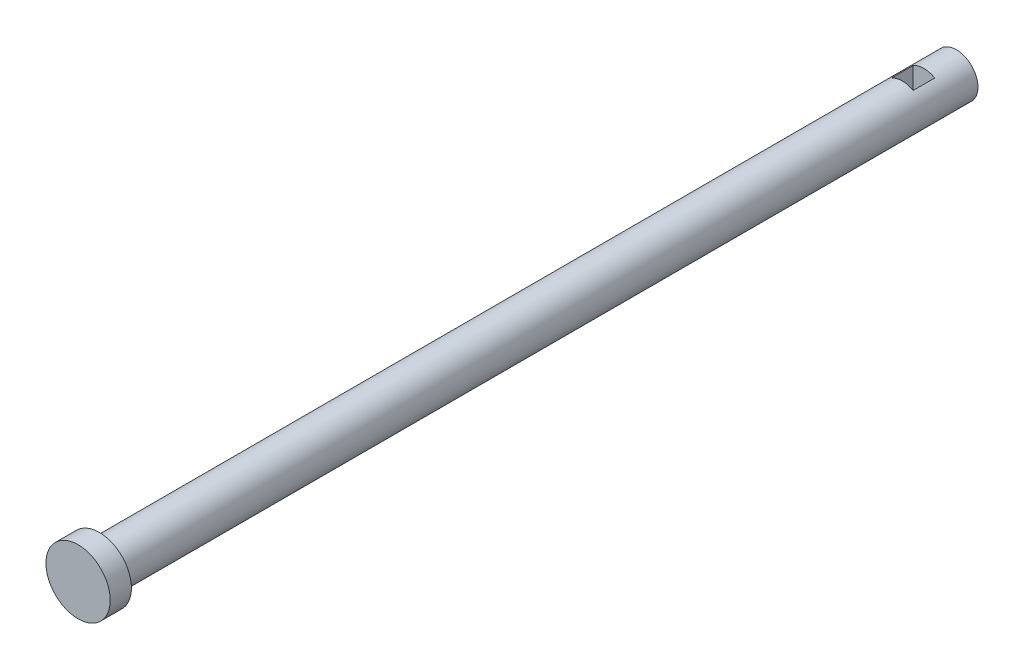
from build123d import *

# Parameters (mm, degrees)
CROQUIS1_R                 = 10
SALIENTE_EXTRUIR1_DEPTH    = 395.8
CROQUIS2_R                 = 14.840770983
SALIENTE_EXTRUIR2_DEPTH    = 9.8
CORTAR_EXTRUIR2_DEPTH      = 407.142655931
CORTAR_EXTRUIR2_DEPTH_BACK = 407.142655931
CROQUIS3_W                 = 10
CROQUIS3_H                 = 10


with BuildPart() as part:
    # Croquis1 → Saliente-Extruir1 (new body)
    with BuildSketch(Plane.XY):
        Circle(CROQUIS1_R)
    extrude(amount=SALIENTE_EXTRUIR1_DEPTH)

    # Croquis2 → Saliente-Extruir2 (add)
    with BuildSketch(Plane.XY.offset(395.8)):
        Circle(CROQUIS2_R)
    extrude(amount=SALIENTE_EXTRUIR2_DEPTH)

    # Croquis3 → Cortar-Extruir2 (cut, two sides: drawn at the far end of the back side and taken through both)
    with BuildSketch(Plane(origin=(0, 0, 0), x_dir=(1, 0, 0), z_dir=(0, 1, 0)).offset(-CORTAR_EXTRUIR2_DEPTH_BACK)):
        with Locations((0, -20)):
            Rectangle(CROQUIS3_W, CROQUIS3_H)
    extrude(amount=CORTAR_EXTRUIR2_DEPTH + CORTAR_EXTRUIR2_DEPTH_BACK, mode=Mode.SUBTRACT)


solid = part.part
